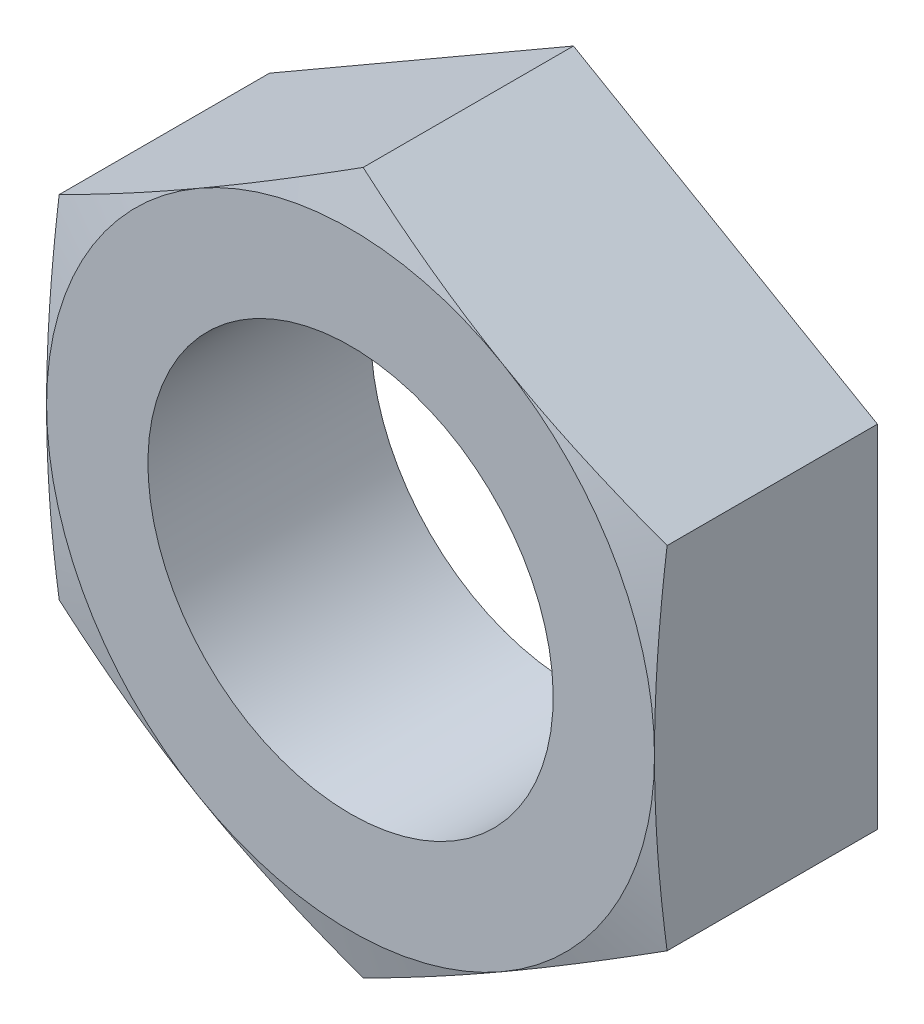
ISO-10303-21;
HEADER;
FILE_DESCRIPTION(('STEP AP214'),'2;1');
FILE_NAME('part.step','',(''),(''),'','','');
FILE_SCHEMA(('AUTOMOTIVE_DESIGN { 1 0 10303 214 1 1 1 1 }'));
ENDSEC;
DATA;
#1=APPLICATION_CONTEXT('core data for automotive mechanical design processes');
#2=APPLICATION_PROTOCOL_DEFINITION('international standard','automotive_design',2000,#1);
#3=PRODUCT_CONTEXT('',#1,'mechanical');
#4=PRODUCT('Part','Part','',(#3));
#5=PRODUCT_RELATED_PRODUCT_CATEGORY('part','',(#4));
#6=PRODUCT_DEFINITION_FORMATION('','',#4);
#7=PRODUCT_DEFINITION_CONTEXT('part definition',#1,'design');
#8=PRODUCT_DEFINITION('design','',#6,#7);
#9=PRODUCT_DEFINITION_SHAPE('','',#8);
#10=(LENGTH_UNIT() NAMED_UNIT(*) SI_UNIT(.MILLI.,.METRE.));
#11=(NAMED_UNIT(*) PLANE_ANGLE_UNIT() SI_UNIT($,.RADIAN.));
#12=(NAMED_UNIT(*) SI_UNIT($,.STERADIAN.) SOLID_ANGLE_UNIT());
#13=UNCERTAINTY_MEASURE_WITH_UNIT(LENGTH_MEASURE(1.E-05),#10,'distance_accuracy_value','');
#14=(GEOMETRIC_REPRESENTATION_CONTEXT(3) GLOBAL_UNCERTAINTY_ASSIGNED_CONTEXT((#13)) GLOBAL_UNIT_ASSIGNED_CONTEXT((#10,
#11,#12)) REPRESENTATION_CONTEXT('',''));
#15=CARTESIAN_POINT('',(0.,0.,0.));
#16=DIRECTION('',(0.,0.,1.));
#17=DIRECTION('',(1.,0.,0.));
#18=AXIS2_PLACEMENT_3D('',#15,#16,#17);
#19=CARTESIAN_POINT('',(0.,0.,10.));
#20=DIRECTION('',(0.,0.,-1.));
#21=DIRECTION('',(0.,1.,0.));
#22=AXIS2_PLACEMENT_3D('',#19,#20,#21);
#23=PLANE('',#22);
#24=CARTESIAN_POINT('',(0.,0.,10.));
#25=DIRECTION('',(0.,0.,-1.));
#26=DIRECTION('',(0.,1.,0.));
#27=AXIS2_PLACEMENT_3D('',#24,#25,#26);
#28=CIRCLE('',#27,15.);
#29=CARTESIAN_POINT('',(15.,0.,10.));
#30=VERTEX_POINT('',#29);
#31=CARTESIAN_POINT('',(7.5,-12.9903810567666,10.));
#32=VERTEX_POINT('',#31);
#33=EDGE_CURVE('E9',#30,#32,#28,.T.);
#34=ORIENTED_EDGE('',*,*,#33,.F.);
#35=CARTESIAN_POINT('',(7.5,12.9903810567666,10.));
#36=VERTEX_POINT('',#35);
#37=EDGE_CURVE('E22',#36,#30,#28,.T.);
#38=ORIENTED_EDGE('',*,*,#37,.F.);
#39=CARTESIAN_POINT('',(-7.5,12.9903810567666,10.));
#40=VERTEX_POINT('',#39);
#41=EDGE_CURVE('E234',#40,#36,#28,.T.);
#42=ORIENTED_EDGE('',*,*,#41,.F.);
#43=CARTESIAN_POINT('',(-15.,0.,10.));
#44=VERTEX_POINT('',#43);
#45=EDGE_CURVE('E236',#44,#40,#28,.T.);
#46=ORIENTED_EDGE('',*,*,#45,.F.);
#47=CARTESIAN_POINT('',(-7.5,-12.9903810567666,10.));
#48=VERTEX_POINT('',#47);
#49=EDGE_CURVE('E244',#48,#44,#28,.T.);
#50=ORIENTED_EDGE('',*,*,#49,.F.);
#51=EDGE_CURVE('E21',#32,#48,#28,.T.);
#52=ORIENTED_EDGE('',*,*,#51,.F.);
#53=EDGE_LOOP('',(#34,#38,#42,#46,#50,#52));
#54=FACE_BOUND('',#53,.T.);
#55=CARTESIAN_POINT('',(0.,0.,10.));
#56=DIRECTION('',(0.,0.,1.));
#57=DIRECTION('',(0.,-1.,0.));
#58=AXIS2_PLACEMENT_3D('',#55,#56,#57);
#59=CIRCLE('',#58,10.);
#60=CARTESIAN_POINT('',(0.,-10.,10.));
#61=VERTEX_POINT('',#60);
#62=EDGE_CURVE('E123',#61,#61,#59,.T.);
#63=ORIENTED_EDGE('',*,*,#62,.F.);
#64=EDGE_LOOP('',(#63));
#65=FACE_BOUND('',#64,.T.);
#66=ADVANCED_FACE('F14',(#54,#65),#23,.F.);
#67=CARTESIAN_POINT('',(0.,0.,10.));
#68=DIRECTION('',(0.,0.,-1.));
#69=DIRECTION('',(0.,1.,0.));
#70=AXIS2_PLACEMENT_3D('',#67,#68,#69);
#71=CONICAL_SURFACE('',#70,15.,1.30899693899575);
#72=CARTESIAN_POINT('',(-0.0002,-17.3206235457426,9.37819079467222));
#73=CARTESIAN_POINT('',(0.62272893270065,-16.9609753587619,9.47459663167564));
#74=CARTESIAN_POINT('',(1.24678727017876,-16.6006751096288,9.56211706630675));
#75=CARTESIAN_POINT('',(2.49710774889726,-15.8788022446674,9.715882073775));
#76=CARTESIAN_POINT('',(3.12337068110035,-15.5172291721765,9.78211800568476));
#77=CARTESIAN_POINT('',(4.37430350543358,-14.7950027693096,9.88944736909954));
#78=CARTESIAN_POINT('',(4.99896493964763,-14.4343543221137,9.93066878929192));
#79=CARTESIAN_POINT('',(6.24908436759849,-13.7125975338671,9.98594247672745));
#80=CARTESIAN_POINT('',(6.87454218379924,-13.3514892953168,10.));
#81=CARTESIAN_POINT('',(8.12545781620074,-12.6292728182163,10.));
#82=CARTESIAN_POINT('',(8.75091563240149,-12.268164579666,9.98594247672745));
#83=CARTESIAN_POINT('',(10.0010350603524,-11.5464077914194,9.93066878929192));
#84=CARTESIAN_POINT('',(10.6256964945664,-11.1857593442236,9.88944736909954));
#85=CARTESIAN_POINT('',(11.8766293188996,-10.4635329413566,9.78211800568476));
#86=CARTESIAN_POINT('',(12.5028922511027,-10.1019598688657,9.715882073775));
#87=CARTESIAN_POINT('',(13.7532127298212,-9.38008700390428,9.56211706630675));
#88=CARTESIAN_POINT('',(14.3772710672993,-9.01978675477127,9.47459663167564));
#89=CARTESIAN_POINT('',(15.0002,-8.66013856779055,9.37819079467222));
#90=B_SPLINE_CURVE_WITH_KNOTS('',3,(#72,#73,#74,#75,#76,#77,#78,#79,#80,#81,#82,#83,#84,#85,#86,
#87,#88,#89),.UNSPECIFIED.,.F.,.F.,(4,2,2,2,2,2,2,2,4),(0.,2.17729853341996,4.35547987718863,
6.52242029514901,8.68894138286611,10.8554624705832,13.0224028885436,15.2005842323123,
17.3778827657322),.UNSPECIFIED.);
#91=CARTESIAN_POINT('',(15.,-8.66025403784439,9.37822173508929));
#92=VERTEX_POINT('',#91);
#93=EDGE_CURVE('E165',#32,#92,#90,.T.);
#94=ORIENTED_EDGE('',*,*,#93,.T.);
#95=CARTESIAN_POINT('',(15.,23.1419881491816,6.6297081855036));
#96=CARTESIAN_POINT('',(15.,22.4587408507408,6.78329430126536));
#97=CARTESIAN_POINT('',(15.,21.7750725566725,6.93504044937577));
#98=CARTESIAN_POINT('',(15.,20.4066866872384,7.23385914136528));
#99=CARTESIAN_POINT('',(15.,19.7219690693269,7.38093149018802));
#100=CARTESIAN_POINT('',(15.,18.3506992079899,7.6695295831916));
#101=CARTESIAN_POINT('',(15.,17.6641458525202,7.8110500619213));
#102=CARTESIAN_POINT('',(15.,16.2896268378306,8.08705413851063));
#103=CARTESIAN_POINT('',(15.,15.6016611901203,8.2215377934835));
#104=CARTESIAN_POINT('',(15.,14.2296503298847,8.48073269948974));
#105=CARTESIAN_POINT('',(15.,13.5456184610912,8.60551424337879));
#106=CARTESIAN_POINT('',(15.,12.1756849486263,8.84443987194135));
#107=CARTESIAN_POINT('',(15.,11.4897832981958,8.95858391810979));
#108=CARTESIAN_POINT('',(15.,10.1159728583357,9.17370947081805));
#109=CARTESIAN_POINT('',(15.,9.42806428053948,9.27469231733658));
#110=CARTESIAN_POINT('',(15.,8.05005119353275,9.46056387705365));
#111=CARTESIAN_POINT('',(15.,7.35994668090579,9.54545256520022));
#112=CARTESIAN_POINT('',(15.,5.96964570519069,9.69678546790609));
#113=CARTESIAN_POINT('',(15.,5.26942453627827,9.76300604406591));
#114=CARTESIAN_POINT('',(15.,3.86717237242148,9.87246427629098));
#115=CARTESIAN_POINT('',(15.,3.16514141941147,9.91570246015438));
#116=CARTESIAN_POINT('',(15.,1.7602989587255,9.97667733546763));
#117=CARTESIAN_POINT('',(15.,1.05748801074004,9.99442666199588));
#118=CARTESIAN_POINT('',(15.,-0.348304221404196,10.0033276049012));
#119=CARTESIAN_POINT('',(15.,-1.05128550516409,9.99447928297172));
#120=CARTESIAN_POINT('',(15.,-2.45910615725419,9.95067622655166));
#121=CARTESIAN_POINT('',(15.,-3.16394236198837,9.91562187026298));
#122=CARTESIAN_POINT('',(15.,-4.57198846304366,9.82142369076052));
#123=CARTESIAN_POINT('',(15.,-5.27519832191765,9.76227931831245));
#124=CARTESIAN_POINT('',(15.,-6.67998575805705,9.62294571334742));
#125=CARTESIAN_POINT('',(15.,-7.38156187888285,9.54274202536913));
#126=CARTESIAN_POINT('',(15.,-8.78244611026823,9.36469849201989));
#127=CARTESIAN_POINT('',(15.,-9.48175421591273,9.26685860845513));
#128=CARTESIAN_POINT('',(15.,-10.8743195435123,9.05732352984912));
#129=CARTESIAN_POINT('',(15.,-11.5675888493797,8.94570787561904));
#130=CARTESIAN_POINT('',(15.,-12.9521789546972,8.71092433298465));
#131=CARTESIAN_POINT('',(15.,-13.6434996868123,8.58775605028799));
#132=CARTESIAN_POINT('',(15.,-15.0244974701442,8.3321065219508));
#133=CARTESIAN_POINT('',(15.,-15.7141743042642,8.1996241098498));
#134=CARTESIAN_POINT('',(15.,-17.0920328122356,7.92716970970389));
#135=CARTESIAN_POINT('',(15.,-17.7802145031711,7.78719780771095));
#136=CARTESIAN_POINT('',(15.,-19.1555374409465,7.5011477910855));
#137=CARTESIAN_POINT('',(15.,-19.8426782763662,7.35506770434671));
#138=CARTESIAN_POINT('',(15.,-21.2158909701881,7.05797135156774));
#139=CARTESIAN_POINT('',(15.,-21.9019628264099,6.90695507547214));
#140=CARTESIAN_POINT('',(15.,-23.2731482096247,6.6008885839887));
#141=CARTESIAN_POINT('',(15.,-23.9582618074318,6.44583868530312));
#142=CARTESIAN_POINT('',(15.,-25.3277233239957,6.13239051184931));
#143=CARTESIAN_POINT('',(15.,-26.0120712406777,5.9739922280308));
#144=CARTESIAN_POINT('',(15.,-28.0494907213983,5.49806458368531));
#145=CARTESIAN_POINT('',(15.,-29.4016189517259,5.17649756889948));
#146=CARTESIAN_POINT('',(15.,-32.1040450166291,4.52566325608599));
#147=CARTESIAN_POINT('',(15.,-33.4543428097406,4.19639578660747));
#148=CARTESIAN_POINT('',(15.,-36.1516336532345,3.53267662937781));
#149=CARTESIAN_POINT('',(15.,-37.4986286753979,3.19823294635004));
#150=CARTESIAN_POINT('',(15.,-39.5182998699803,2.69339084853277));
#151=CARTESIAN_POINT('',(15.,-40.1913746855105,2.52458376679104));
#152=CARTESIAN_POINT('',(15.,-41.5372883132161,2.18603409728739));
#153=CARTESIAN_POINT('',(15.,-42.2101271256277,2.01629151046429));
#154=CARTESIAN_POINT('',(15.,-42.8828634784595,1.84614364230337));
#155=B_SPLINE_CURVE_WITH_KNOTS('',3,(#95,#96,#97,#98,#99,#100,#101,#102,#103,#104,#105,#106,
#107,#108,#109,#110,#111,#112,#113,#114,#115,#116,#117,#118,#119,#120,#121,#122,#123,#124,#125,
#126,#127,#128,#129,#130,#131,#132,#133,#134,#135,#136,#137,#138,#139,#140,#141,#142,#143,#144,
#145,#146,#147,#148,#149,#150,#151,#152,#153,#154),.UNSPECIFIED.,.F.,.F.,(4,2,2,2,2,2,2,2,2,2,2,
2,2,2,2,2,2,2,2,2,2,2,2,2,2,2,2,2,2,4),(0.,2.10089856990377,4.20188470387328,6.30481750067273,
8.40773322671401,10.4936264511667,12.579527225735,14.6652154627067,16.7509069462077,
18.860614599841,20.9702738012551,23.0788868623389,25.1874950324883,27.3041600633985,
29.4208733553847,31.5390434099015,33.6572180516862,35.7636892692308,37.8702324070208,
39.9770398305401,42.0838230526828,44.1912918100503,46.2987648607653,48.4060729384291,
50.5133867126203,54.6828708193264,58.8524478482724,63.0161182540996,65.0978790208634,
67.179637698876),.UNSPECIFIED.);
#156=EDGE_CURVE('E180',#92,#30,#155,.F.);
#157=ORIENTED_EDGE('',*,*,#156,.T.);
#158=ORIENTED_EDGE('',*,*,#33,.T.);
#159=EDGE_LOOP('',(#94,#157,#158));
#160=FACE_BOUND('',#159,.T.);
#161=ADVANCED_FACE('F210',(#160),#71,.T.);
#162=ORIENTED_EDGE('',*,*,#37,.T.);
#163=CARTESIAN_POINT('',(15.,8.66025403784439,9.37822173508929));
#164=VERTEX_POINT('',#163);
#165=EDGE_CURVE('E173',#30,#164,#155,.F.);
#166=ORIENTED_EDGE('',*,*,#165,.T.);
#167=CARTESIAN_POINT('',(15.0002,8.66013856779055,9.37819079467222));
#168=CARTESIAN_POINT('',(14.3772710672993,9.01978675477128,9.47459663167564));
#169=CARTESIAN_POINT('',(13.7532127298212,9.3800870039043,9.56211706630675));
#170=CARTESIAN_POINT('',(12.5028922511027,10.1019598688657,9.71588207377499));
#171=CARTESIAN_POINT('',(11.8766293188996,10.4635329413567,9.78211800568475));
#172=CARTESIAN_POINT('',(10.6256964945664,11.1857593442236,9.88944736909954));
#173=CARTESIAN_POINT('',(10.0010350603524,11.5464077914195,9.93066878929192));
#174=CARTESIAN_POINT('',(8.7509156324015,12.2681645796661,9.98594247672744));
#175=CARTESIAN_POINT('',(8.12545781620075,12.6292728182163,10.));
#176=CARTESIAN_POINT('',(6.87454218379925,13.3514892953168,10.));
#177=CARTESIAN_POINT('',(6.2490843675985,13.7125975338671,9.98594247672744));
#178=CARTESIAN_POINT('',(4.99896493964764,14.4343543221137,9.93066878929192));
#179=CARTESIAN_POINT('',(4.37430350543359,14.7950027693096,9.88944736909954));
#180=CARTESIAN_POINT('',(3.12337068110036,15.5172291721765,9.78211800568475));
#181=CARTESIAN_POINT('',(2.49710774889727,15.8788022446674,9.71588207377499));
#182=CARTESIAN_POINT('',(1.24678727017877,16.6006751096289,9.56211706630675));
#183=CARTESIAN_POINT('',(0.622728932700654,16.9609753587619,9.47459663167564));
#184=CARTESIAN_POINT('',(-0.000200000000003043,17.3206235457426,9.37819079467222));
#185=B_SPLINE_CURVE_WITH_KNOTS('',3,(#167,#168,#169,#170,#171,#172,#173,#174,#175,#176,#177,
#178,#179,#180,#181,#182,#183,#184),.UNSPECIFIED.,.F.,.F.,(4,2,2,2,2,2,2,2,4),(0.,
2.17729853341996,4.35547987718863,6.52242029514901,8.68894138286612,10.8554624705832,
13.0224028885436,15.2005842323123,17.3778827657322),.UNSPECIFIED.);
#186=EDGE_CURVE('E187',#164,#36,#185,.T.);
#187=ORIENTED_EDGE('',*,*,#186,.T.);
#188=EDGE_LOOP('',(#162,#166,#187));
#189=FACE_BOUND('',#188,.T.);
#190=ADVANCED_FACE('F216',(#189),#71,.T.);
#191=ORIENTED_EDGE('',*,*,#41,.T.);
#192=CARTESIAN_POINT('',(0.,17.3205080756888,9.37822173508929));
#193=VERTEX_POINT('',#192);
#194=EDGE_CURVE('E181',#36,#193,#185,.T.);
#195=ORIENTED_EDGE('',*,*,#194,.T.);
#196=CARTESIAN_POINT('',(0.0002,17.3206235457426,9.37819079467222));
#197=CARTESIAN_POINT('',(-0.62272893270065,16.9609753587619,9.47459663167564));
#198=CARTESIAN_POINT('',(-1.24678727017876,16.6006751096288,9.56211706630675));
#199=CARTESIAN_POINT('',(-2.49710774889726,15.8788022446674,9.715882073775));
#200=CARTESIAN_POINT('',(-3.12337068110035,15.5172291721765,9.78211800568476));
#201=CARTESIAN_POINT('',(-4.37430350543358,14.7950027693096,9.88944736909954));
#202=CARTESIAN_POINT('',(-4.99896493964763,14.4343543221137,9.93066878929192));
#203=CARTESIAN_POINT('',(-6.24908436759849,13.7125975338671,9.98594247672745));
#204=CARTESIAN_POINT('',(-6.87454218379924,13.3514892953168,10.));
#205=CARTESIAN_POINT('',(-8.12545781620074,12.6292728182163,10.));
#206=CARTESIAN_POINT('',(-8.75091563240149,12.268164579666,9.98594247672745));
#207=CARTESIAN_POINT('',(-10.0010350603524,11.5464077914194,9.93066878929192));
#208=CARTESIAN_POINT('',(-10.6256964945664,11.1857593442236,9.88944736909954));
#209=CARTESIAN_POINT('',(-11.8766293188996,10.4635329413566,9.78211800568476));
#210=CARTESIAN_POINT('',(-12.5028922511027,10.1019598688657,9.715882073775));
#211=CARTESIAN_POINT('',(-13.7532127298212,9.38008700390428,9.56211706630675));
#212=CARTESIAN_POINT('',(-14.3772710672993,9.01978675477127,9.47459663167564));
#213=CARTESIAN_POINT('',(-15.0002,8.66013856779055,9.37819079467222));
#214=B_SPLINE_CURVE_WITH_KNOTS('',3,(#196,#197,#198,#199,#200,#201,#202,#203,#204,#205,#206,
#207,#208,#209,#210,#211,#212,#213),.UNSPECIFIED.,.F.,.F.,(4,2,2,2,2,2,2,2,4),(0.,
2.17729853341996,4.35547987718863,6.52242029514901,8.68894138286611,10.8554624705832,
13.0224028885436,15.2005842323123,17.3778827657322),.UNSPECIFIED.);
#215=EDGE_CURVE('E235',#193,#40,#214,.T.);
#216=ORIENTED_EDGE('',*,*,#215,.T.);
#217=EDGE_LOOP('',(#191,#195,#216));
#218=FACE_BOUND('',#217,.T.);
#219=ADVANCED_FACE('F311',(#218),#71,.T.);
#220=CARTESIAN_POINT('',(-15.0002,-8.66013856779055,9.37819079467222));
#221=CARTESIAN_POINT('',(-14.3772710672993,-9.01978675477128,9.47459663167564));
#222=CARTESIAN_POINT('',(-13.7532127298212,-9.3800870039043,9.56211706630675));
#223=CARTESIAN_POINT('',(-12.5028922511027,-10.1019598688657,9.71588207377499));
#224=CARTESIAN_POINT('',(-11.8766293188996,-10.4635329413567,9.78211800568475));
#225=CARTESIAN_POINT('',(-10.6256964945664,-11.1857593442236,9.88944736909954));
#226=CARTESIAN_POINT('',(-10.0010350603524,-11.5464077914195,9.93066878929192));
#227=CARTESIAN_POINT('',(-8.7509156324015,-12.2681645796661,9.98594247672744));
#228=CARTESIAN_POINT('',(-8.12545781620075,-12.6292728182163,10.));
#229=CARTESIAN_POINT('',(-6.87454218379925,-13.3514892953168,10.));
#230=CARTESIAN_POINT('',(-6.2490843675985,-13.7125975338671,9.98594247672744));
#231=CARTESIAN_POINT('',(-4.99896493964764,-14.4343543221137,9.93066878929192));
#232=CARTESIAN_POINT('',(-4.37430350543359,-14.7950027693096,9.88944736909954));
#233=CARTESIAN_POINT('',(-3.12337068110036,-15.5172291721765,9.78211800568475));
#234=CARTESIAN_POINT('',(-2.49710774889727,-15.8788022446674,9.71588207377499));
#235=CARTESIAN_POINT('',(-1.24678727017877,-16.6006751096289,9.56211706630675));
#236=CARTESIAN_POINT('',(-0.622728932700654,-16.9609753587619,9.47459663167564));
#237=CARTESIAN_POINT('',(0.000200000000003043,-17.3206235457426,9.37819079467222));
#238=B_SPLINE_CURVE_WITH_KNOTS('',3,(#220,#221,#222,#223,#224,#225,#226,#227,#228,#229,#230,
#231,#232,#233,#234,#235,#236,#237),.UNSPECIFIED.,.F.,.F.,(4,2,2,2,2,2,2,2,4),(0.,
2.17729853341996,4.35547987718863,6.52242029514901,8.68894138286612,10.8554624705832,
13.0224028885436,15.2005842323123,17.3778827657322),.UNSPECIFIED.);
#239=CARTESIAN_POINT('',(0.,-17.3205080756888,9.37822173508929));
#240=VERTEX_POINT('',#239);
#241=EDGE_CURVE('E143',#48,#240,#238,.T.);
#242=ORIENTED_EDGE('',*,*,#241,.T.);
#243=EDGE_CURVE('E93',#240,#32,#90,.T.);
#244=ORIENTED_EDGE('',*,*,#243,.T.);
#245=ORIENTED_EDGE('',*,*,#51,.T.);
#246=EDGE_LOOP('',(#242,#244,#245));
#247=FACE_BOUND('',#246,.T.);
#248=ADVANCED_FACE('F248',(#247),#71,.T.);
#249=ORIENTED_EDGE('',*,*,#45,.T.);
#250=CARTESIAN_POINT('',(-15.,8.66025403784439,9.37822173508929));
#251=VERTEX_POINT('',#250);
#252=EDGE_CURVE('E37',#40,#251,#214,.T.);
#253=ORIENTED_EDGE('',*,*,#252,.T.);
#254=CARTESIAN_POINT('',(-15.,23.1419881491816,6.6297081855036));
#255=CARTESIAN_POINT('',(-15.,22.4587408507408,6.78329430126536));
#256=CARTESIAN_POINT('',(-15.,21.7750725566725,6.93504044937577));
#257=CARTESIAN_POINT('',(-15.,20.4066866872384,7.23385914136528));
#258=CARTESIAN_POINT('',(-15.,19.7219690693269,7.38093149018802));
#259=CARTESIAN_POINT('',(-15.,18.3506992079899,7.6695295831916));
#260=CARTESIAN_POINT('',(-15.,17.6641458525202,7.8110500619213));
#261=CARTESIAN_POINT('',(-15.,16.2896268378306,8.08705413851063));
#262=CARTESIAN_POINT('',(-15.,15.6016611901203,8.2215377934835));
#263=CARTESIAN_POINT('',(-15.,14.2296503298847,8.48073269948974));
#264=CARTESIAN_POINT('',(-15.,13.5456184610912,8.60551424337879));
#265=CARTESIAN_POINT('',(-15.,12.1756849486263,8.84443987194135));
#266=CARTESIAN_POINT('',(-15.,11.4897832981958,8.95858391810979));
#267=CARTESIAN_POINT('',(-15.,10.1159728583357,9.17370947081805));
#268=CARTESIAN_POINT('',(-15.,9.42806428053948,9.27469231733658));
#269=CARTESIAN_POINT('',(-15.,8.05005119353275,9.46056387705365));
#270=CARTESIAN_POINT('',(-15.,7.35994668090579,9.54545256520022));
#271=CARTESIAN_POINT('',(-15.,5.96964570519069,9.69678546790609));
#272=CARTESIAN_POINT('',(-15.,5.26942453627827,9.76300604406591));
#273=CARTESIAN_POINT('',(-15.,3.86717237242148,9.87246427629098));
#274=CARTESIAN_POINT('',(-15.,3.16514141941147,9.91570246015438));
#275=CARTESIAN_POINT('',(-15.,1.7602989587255,9.97667733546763));
#276=CARTESIAN_POINT('',(-15.,1.05748801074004,9.99442666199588));
#277=CARTESIAN_POINT('',(-15.,-0.348304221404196,10.0033276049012));
#278=CARTESIAN_POINT('',(-15.,-1.05128550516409,9.99447928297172));
#279=CARTESIAN_POINT('',(-15.,-2.45910615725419,9.95067622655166));
#280=CARTESIAN_POINT('',(-15.,-3.16394236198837,9.91562187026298));
#281=CARTESIAN_POINT('',(-15.,-4.57198846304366,9.82142369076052));
#282=CARTESIAN_POINT('',(-15.,-5.27519832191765,9.76227931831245));
#283=CARTESIAN_POINT('',(-15.,-6.67998575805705,9.62294571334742));
#284=CARTESIAN_POINT('',(-15.,-7.38156187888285,9.54274202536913));
#285=CARTESIAN_POINT('',(-15.,-8.78244611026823,9.36469849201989));
#286=CARTESIAN_POINT('',(-15.,-9.48175421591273,9.26685860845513));
#287=CARTESIAN_POINT('',(-15.,-10.8743195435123,9.05732352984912));
#288=CARTESIAN_POINT('',(-15.,-11.5675888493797,8.94570787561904));
#289=CARTESIAN_POINT('',(-15.,-12.9521789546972,8.71092433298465));
#290=CARTESIAN_POINT('',(-15.,-13.6434996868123,8.58775605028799));
#291=CARTESIAN_POINT('',(-15.,-15.0244974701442,8.3321065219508));
#292=CARTESIAN_POINT('',(-15.,-15.7141743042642,8.1996241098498));
#293=CARTESIAN_POINT('',(-15.,-17.0920328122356,7.92716970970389));
#294=CARTESIAN_POINT('',(-15.,-17.7802145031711,7.78719780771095));
#295=CARTESIAN_POINT('',(-15.,-19.1555374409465,7.5011477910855));
#296=CARTESIAN_POINT('',(-15.,-19.8426782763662,7.35506770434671));
#297=CARTESIAN_POINT('',(-15.,-21.2158909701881,7.05797135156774));
#298=CARTESIAN_POINT('',(-15.,-21.9019628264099,6.90695507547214));
#299=CARTESIAN_POINT('',(-15.,-23.2731482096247,6.6008885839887));
#300=CARTESIAN_POINT('',(-15.,-23.9582618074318,6.44583868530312));
#301=CARTESIAN_POINT('',(-15.,-25.3277233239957,6.13239051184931));
#302=CARTESIAN_POINT('',(-15.,-26.0120712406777,5.9739922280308));
#303=CARTESIAN_POINT('',(-15.,-28.0494907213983,5.49806458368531));
#304=CARTESIAN_POINT('',(-15.,-29.4016189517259,5.17649756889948));
#305=CARTESIAN_POINT('',(-15.,-32.1040450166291,4.52566325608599));
#306=CARTESIAN_POINT('',(-15.,-33.4543428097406,4.19639578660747));
#307=CARTESIAN_POINT('',(-15.,-36.1516336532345,3.53267662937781));
#308=CARTESIAN_POINT('',(-15.,-37.4986286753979,3.19823294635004));
#309=CARTESIAN_POINT('',(-15.,-39.5182998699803,2.69339084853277));
#310=CARTESIAN_POINT('',(-15.,-40.1913746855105,2.52458376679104));
#311=CARTESIAN_POINT('',(-15.,-41.5372883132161,2.18603409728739));
#312=CARTESIAN_POINT('',(-15.,-42.2101271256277,2.01629151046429));
#313=CARTESIAN_POINT('',(-15.,-42.8828634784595,1.84614364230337));
#314=B_SPLINE_CURVE_WITH_KNOTS('',3,(#254,#255,#256,#257,#258,#259,#260,#261,#262,#263,#264,
#265,#266,#267,#268,#269,#270,#271,#272,#273,#274,#275,#276,#277,#278,#279,#280,#281,#282,#283,
#284,#285,#286,#287,#288,#289,#290,#291,#292,#293,#294,#295,#296,#297,#298,#299,#300,#301,#302,
#303,#304,#305,#306,#307,#308,#309,#310,#311,#312,#313),.UNSPECIFIED.,.F.,.F.,(4,2,2,2,2,2,2,2,
2,2,2,2,2,2,2,2,2,2,2,2,2,2,2,2,2,2,2,2,2,4),(0.,2.10089856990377,4.20188470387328,
6.30481750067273,8.40773322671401,10.4936264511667,12.579527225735,14.6652154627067,
16.7509069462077,18.860614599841,20.9702738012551,23.0788868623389,25.1874950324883,
27.3041600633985,29.4208733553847,31.5390434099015,33.6572180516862,35.7636892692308,
37.8702324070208,39.9770398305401,42.0838230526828,44.1912918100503,46.2987648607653,
48.4060729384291,50.5133867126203,54.6828708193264,58.8524478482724,63.0161182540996,
65.0978790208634,67.179637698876),.UNSPECIFIED.);
#315=EDGE_CURVE('E142',#251,#44,#314,.T.);
#316=ORIENTED_EDGE('',*,*,#315,.T.);
#317=EDGE_LOOP('',(#249,#253,#316));
#318=FACE_BOUND('',#317,.T.);
#319=ADVANCED_FACE('F241',(#318),#71,.T.);
#320=CARTESIAN_POINT('',(-15.,-8.66025403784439,9.3782217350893));
#321=VERTEX_POINT('',#320);
#322=EDGE_CURVE('E129',#44,#321,#314,.T.);
#323=ORIENTED_EDGE('',*,*,#322,.T.);
#324=EDGE_CURVE('E172',#321,#48,#238,.T.);
#325=ORIENTED_EDGE('',*,*,#324,.T.);
#326=ORIENTED_EDGE('',*,*,#49,.T.);
#327=EDGE_LOOP('',(#323,#325,#326));
#328=FACE_BOUND('',#327,.T.);
#329=ADVANCED_FACE('F150',(#328),#71,.T.);
#330=CARTESIAN_POINT('',(0.,17.3205080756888,49.5));
#331=DIRECTION('',(0.5,-0.866025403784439,0.));
#332=DIRECTION('',(0.866025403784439,0.5,0.));
#333=AXIS2_PLACEMENT_3D('',#330,#331,#332);
#334=PLANE('',#333);
#335=DIRECTION('',(0.,0.,-1.));
#336=VECTOR('',#335,1.);
#337=CARTESIAN_POINT('',(0.,17.3205080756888,49.5));
#338=LINE('',#337,#336);
#339=CARTESIAN_POINT('',(0.,17.3205080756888,-1.));
#340=VERTEX_POINT('',#339);
#341=EDGE_CURVE('E127',#193,#340,#338,.T.);
#342=ORIENTED_EDGE('',*,*,#341,.T.);
#343=DIRECTION('',(0.866025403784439,0.5,0.));
#344=VECTOR('',#343,1.);
#345=CARTESIAN_POINT('',(-15.,8.66025403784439,-1.));
#346=LINE('',#345,#344);
#347=CARTESIAN_POINT('',(-15.,8.66025403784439,-1.));
#348=VERTEX_POINT('',#347);
#349=EDGE_CURVE('E117',#348,#340,#346,.T.);
#350=ORIENTED_EDGE('',*,*,#349,.F.);
#351=DIRECTION('',(0.,0.,-1.));
#352=VECTOR('',#351,1.);
#353=CARTESIAN_POINT('',(-15.,8.66025403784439,49.5));
#354=LINE('',#353,#352);
#355=EDGE_CURVE('E126',#251,#348,#354,.T.);
#356=ORIENTED_EDGE('',*,*,#355,.F.);
#357=ORIENTED_EDGE('',*,*,#252,.F.);
#358=ORIENTED_EDGE('',*,*,#215,.F.);
#359=EDGE_LOOP('',(#342,#350,#356,#357,#358));
#360=FACE_BOUND('',#359,.T.);
#361=ADVANCED_FACE('F196',(#360),#334,.F.);
#362=CARTESIAN_POINT('',(15.,8.66025403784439,49.5));
#363=DIRECTION('',(-0.5,-0.866025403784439,0.));
#364=DIRECTION('',(0.866025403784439,-0.5,0.));
#365=AXIS2_PLACEMENT_3D('',#362,#363,#364);
#366=PLANE('',#365);
#367=DIRECTION('',(0.,0.,-1.));
#368=VECTOR('',#367,1.);
#369=CARTESIAN_POINT('',(15.,8.66025403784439,49.5));
#370=LINE('',#369,#368);
#371=CARTESIAN_POINT('',(15.,8.66025403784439,-1.));
#372=VERTEX_POINT('',#371);
#373=EDGE_CURVE('E130',#164,#372,#370,.T.);
#374=ORIENTED_EDGE('',*,*,#373,.T.);
#375=DIRECTION('',(0.866025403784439,-0.5,0.));
#376=VECTOR('',#375,1.);
#377=CARTESIAN_POINT('',(0.,17.3205080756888,-1.));
#378=LINE('',#377,#376);
#379=EDGE_CURVE('E120',#340,#372,#378,.T.);
#380=ORIENTED_EDGE('',*,*,#379,.F.);
#381=ORIENTED_EDGE('',*,*,#341,.F.);
#382=ORIENTED_EDGE('',*,*,#194,.F.);
#383=ORIENTED_EDGE('',*,*,#186,.F.);
#384=EDGE_LOOP('',(#374,#380,#381,#382,#383));
#385=FACE_BOUND('',#384,.T.);
#386=ADVANCED_FACE('F193',(#385),#366,.F.);
#387=CARTESIAN_POINT('',(15.,-8.66025403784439,49.5));
#388=DIRECTION('',(-1.,0.,0.));
#389=DIRECTION('',(0.,-1.,0.));
#390=AXIS2_PLACEMENT_3D('',#387,#388,#389);
#391=PLANE('',#390);
#392=DIRECTION('',(0.,-1.,0.));
#393=VECTOR('',#392,1.);
#394=CARTESIAN_POINT('',(15.,8.66025403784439,-1.));
#395=LINE('',#394,#393);
#396=CARTESIAN_POINT('',(15.,-8.66025403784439,-1.));
#397=VERTEX_POINT('',#396);
#398=EDGE_CURVE('E110',#372,#397,#395,.T.);
#399=ORIENTED_EDGE('',*,*,#398,.F.);
#400=ORIENTED_EDGE('',*,*,#373,.F.);
#401=ORIENTED_EDGE('',*,*,#165,.F.);
#402=ORIENTED_EDGE('',*,*,#156,.F.);
#403=DIRECTION('',(0.,0.,-1.));
#404=VECTOR('',#403,1.);
#405=CARTESIAN_POINT('',(15.,-8.66025403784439,49.5));
#406=LINE('',#405,#404);
#407=EDGE_CURVE('E96',#92,#397,#406,.T.);
#408=ORIENTED_EDGE('',*,*,#407,.T.);
#409=EDGE_LOOP('',(#399,#400,#401,#402,#408));
#410=FACE_BOUND('',#409,.T.);
#411=ADVANCED_FACE('F162',(#410),#391,.F.);
#412=CARTESIAN_POINT('',(0.,-17.3205080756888,49.5));
#413=DIRECTION('',(-0.5,0.866025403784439,0.));
#414=DIRECTION('',(-0.866025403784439,-0.5,0.));
#415=AXIS2_PLACEMENT_3D('',#412,#413,#414);
#416=PLANE('',#415);
#417=DIRECTION('',(0.,0.,-1.));
#418=VECTOR('',#417,1.);
#419=CARTESIAN_POINT('',(0.,-17.3205080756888,49.5));
#420=LINE('',#419,#418);
#421=CARTESIAN_POINT('',(0.,-17.3205080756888,-1.));
#422=VERTEX_POINT('',#421);
#423=EDGE_CURVE('E86',#240,#422,#420,.T.);
#424=ORIENTED_EDGE('',*,*,#423,.T.);
#425=DIRECTION('',(-0.866025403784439,-0.5,0.));
#426=VECTOR('',#425,1.);
#427=CARTESIAN_POINT('',(15.,-8.66025403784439,-1.));
#428=LINE('',#427,#426);
#429=EDGE_CURVE('E91',#397,#422,#428,.T.);
#430=ORIENTED_EDGE('',*,*,#429,.F.);
#431=ORIENTED_EDGE('',*,*,#407,.F.);
#432=ORIENTED_EDGE('',*,*,#93,.F.);
#433=ORIENTED_EDGE('',*,*,#243,.F.);
#434=EDGE_LOOP('',(#424,#430,#431,#432,#433));
#435=FACE_BOUND('',#434,.T.);
#436=ADVANCED_FACE('F88',(#435),#416,.F.);
#437=CARTESIAN_POINT('',(-15.,-8.66025403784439,49.5));
#438=DIRECTION('',(0.5,0.866025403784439,0.));
#439=DIRECTION('',(-0.866025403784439,0.5,0.));
#440=AXIS2_PLACEMENT_3D('',#437,#438,#439);
#441=PLANE('',#440);
#442=DIRECTION('',(0.,0.,-1.));
#443=VECTOR('',#442,1.);
#444=CARTESIAN_POINT('',(-15.,-8.66025403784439,49.5));
#445=LINE('',#444,#443);
#446=CARTESIAN_POINT('',(-15.,-8.66025403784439,-1.));
#447=VERTEX_POINT('',#446);
#448=EDGE_CURVE('E29',#321,#447,#445,.T.);
#449=ORIENTED_EDGE('',*,*,#448,.T.);
#450=DIRECTION('',(-0.866025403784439,0.5,0.));
#451=VECTOR('',#450,1.);
#452=CARTESIAN_POINT('',(0.,-17.3205080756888,-1.));
#453=LINE('',#452,#451);
#454=EDGE_CURVE('E99',#422,#447,#453,.T.);
#455=ORIENTED_EDGE('',*,*,#454,.F.);
#456=ORIENTED_EDGE('',*,*,#423,.F.);
#457=ORIENTED_EDGE('',*,*,#241,.F.);
#458=ORIENTED_EDGE('',*,*,#324,.F.);
#459=EDGE_LOOP('',(#449,#455,#456,#457,#458));
#460=FACE_BOUND('',#459,.T.);
#461=ADVANCED_FACE('F100',(#460),#441,.F.);
#462=CARTESIAN_POINT('',(-15.,8.66025403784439,49.5));
#463=DIRECTION('',(1.,0.,0.));
#464=DIRECTION('',(0.,1.,0.));
#465=AXIS2_PLACEMENT_3D('',#462,#463,#464);
#466=PLANE('',#465);
#467=DIRECTION('',(0.,1.,0.));
#468=VECTOR('',#467,1.);
#469=CARTESIAN_POINT('',(-15.,-8.66025403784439,-1.));
#470=LINE('',#469,#468);
#471=EDGE_CURVE('E103',#447,#348,#470,.T.);
#472=ORIENTED_EDGE('',*,*,#471,.F.);
#473=ORIENTED_EDGE('',*,*,#448,.F.);
#474=ORIENTED_EDGE('',*,*,#322,.F.);
#475=ORIENTED_EDGE('',*,*,#315,.F.);
#476=ORIENTED_EDGE('',*,*,#355,.T.);
#477=EDGE_LOOP('',(#472,#473,#474,#475,#476));
#478=FACE_BOUND('',#477,.T.);
#479=ADVANCED_FACE('F152',(#478),#466,.F.);
#480=CARTESIAN_POINT('',(0.,0.,-1.));
#481=DIRECTION('',(0.,0.,1.));
#482=DIRECTION('',(0.,-1.,0.));
#483=AXIS2_PLACEMENT_3D('',#480,#481,#482);
#484=CYLINDRICAL_SURFACE('',#483,10.);
#485=ORIENTED_EDGE('',*,*,#62,.T.);
#486=EDGE_LOOP('',(#485));
#487=FACE_BOUND('',#486,.T.);
#488=CARTESIAN_POINT('',(0.,0.,-1.));
#489=DIRECTION('',(0.,0.,-1.));
#490=DIRECTION('',(0.,1.,0.));
#491=AXIS2_PLACEMENT_3D('',#488,#489,#490);
#492=CIRCLE('',#491,10.);
#493=CARTESIAN_POINT('',(0.,10.,-1.));
#494=VERTEX_POINT('',#493);
#495=EDGE_CURVE('E111',#494,#494,#492,.T.);
#496=ORIENTED_EDGE('',*,*,#495,.T.);
#497=EDGE_LOOP('',(#496));
#498=FACE_BOUND('',#497,.T.);
#499=ADVANCED_FACE('F155',(#487,#498),#484,.F.);
#500=CARTESIAN_POINT('',(0.,0.,-1.));
#501=DIRECTION('',(0.,0.,-1.));
#502=DIRECTION('',(0.,1.,0.));
#503=AXIS2_PLACEMENT_3D('',#500,#501,#502);
#504=PLANE('',#503);
#505=ORIENTED_EDGE('',*,*,#429,.T.);
#506=ORIENTED_EDGE('',*,*,#454,.T.);
#507=ORIENTED_EDGE('',*,*,#471,.T.);
#508=ORIENTED_EDGE('',*,*,#349,.T.);
#509=ORIENTED_EDGE('',*,*,#379,.T.);
#510=ORIENTED_EDGE('',*,*,#398,.T.);
#511=EDGE_LOOP('',(#505,#506,#507,#508,#509,#510));
#512=FACE_BOUND('',#511,.T.);
#513=ORIENTED_EDGE('',*,*,#495,.F.);
#514=EDGE_LOOP('',(#513));
#515=FACE_BOUND('',#514,.T.);
#516=ADVANCED_FACE('F106',(#512,#515),#504,.T.);
#517=CLOSED_SHELL('',(#66,#161,#190,#219,#248,#319,#329,#361,#386,#411,#436,#461,#479,#499,#516));
#518=MANIFOLD_SOLID_BREP('B1',#517);
#519=ADVANCED_BREP_SHAPE_REPRESENTATION('',(#18,#518),#14);
#520=SHAPE_DEFINITION_REPRESENTATION(#9,#519);
ENDSEC;
END-ISO-10303-21;
